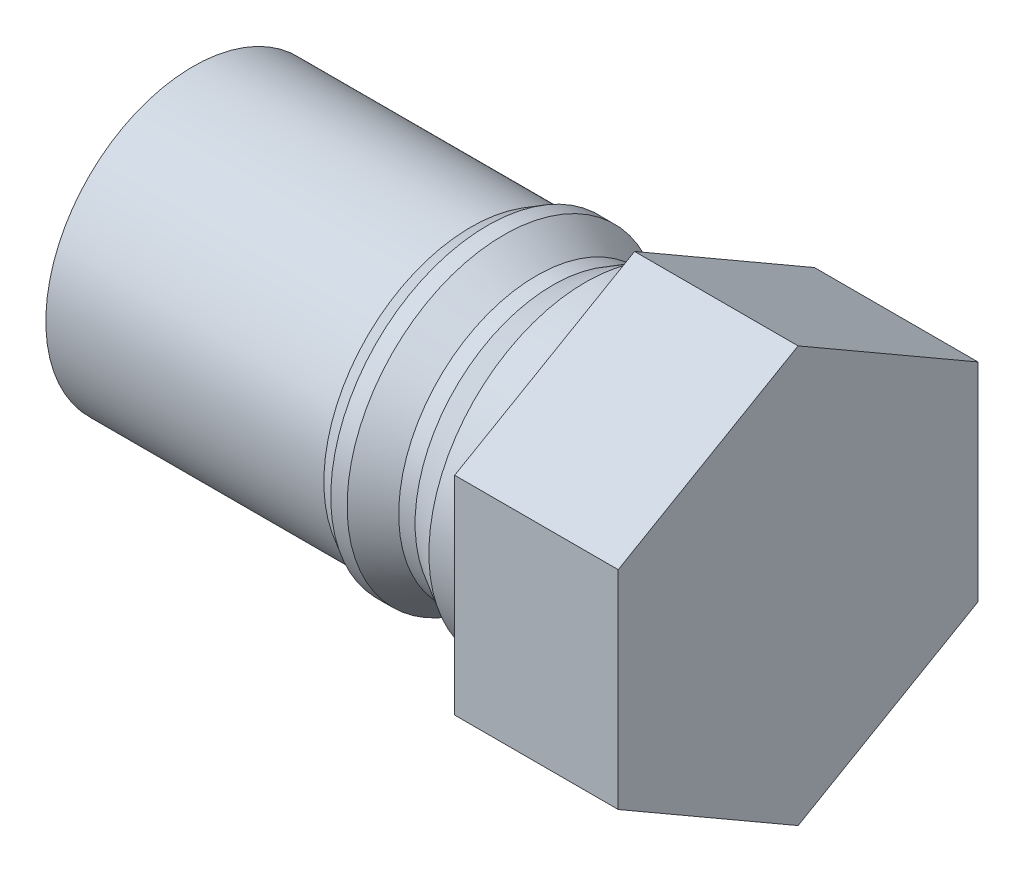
ISO-10303-21;
HEADER;
FILE_DESCRIPTION(('STEP AP214'),'2;1');
FILE_NAME('part.step','',(''),(''),'','','');
FILE_SCHEMA(('AUTOMOTIVE_DESIGN { 1 0 10303 214 1 1 1 1 }'));
ENDSEC;
DATA;
#1=APPLICATION_CONTEXT('core data for automotive mechanical design processes');
#2=APPLICATION_PROTOCOL_DEFINITION('international standard','automotive_design',2000,#1);
#3=PRODUCT_CONTEXT('',#1,'mechanical');
#4=PRODUCT('Part','Part','',(#3));
#5=PRODUCT_RELATED_PRODUCT_CATEGORY('part','',(#4));
#6=PRODUCT_DEFINITION_FORMATION('','',#4);
#7=PRODUCT_DEFINITION_CONTEXT('part definition',#1,'design');
#8=PRODUCT_DEFINITION('design','',#6,#7);
#9=PRODUCT_DEFINITION_SHAPE('','',#8);
#10=(LENGTH_UNIT() NAMED_UNIT(*) SI_UNIT(.MILLI.,.METRE.));
#11=(NAMED_UNIT(*) PLANE_ANGLE_UNIT() SI_UNIT($,.RADIAN.));
#12=(NAMED_UNIT(*) SI_UNIT($,.STERADIAN.) SOLID_ANGLE_UNIT());
#13=UNCERTAINTY_MEASURE_WITH_UNIT(LENGTH_MEASURE(1.E-05),#10,'distance_accuracy_value','');
#14=(GEOMETRIC_REPRESENTATION_CONTEXT(3) GLOBAL_UNCERTAINTY_ASSIGNED_CONTEXT((#13)) GLOBAL_UNIT_ASSIGNED_CONTEXT((#10,
#11,#12)) REPRESENTATION_CONTEXT('',''));
#15=CARTESIAN_POINT('',(0.,0.,0.));
#16=DIRECTION('',(0.,0.,1.));
#17=DIRECTION('',(1.,0.,0.));
#18=AXIS2_PLACEMENT_3D('',#15,#16,#17);
#19=CARTESIAN_POINT('',(0.,0.,0.));
#20=DIRECTION('',(-1.,0.,0.));
#21=DIRECTION('',(0.,0.,1.));
#22=AXIS2_PLACEMENT_3D('',#19,#20,#21);
#23=PLANE('',#22);
#24=CARTESIAN_POINT('',(0.,0.,0.));
#25=DIRECTION('',(1.,0.,0.));
#26=DIRECTION('',(0.,0.,-1.));
#27=AXIS2_PLACEMENT_3D('',#24,#25,#26);
#28=CIRCLE('',#27,9.);
#29=CARTESIAN_POINT('',(0.,0.,-9.));
#30=VERTEX_POINT('',#29);
#31=EDGE_CURVE('E11',#30,#30,#28,.T.);
#32=ORIENTED_EDGE('',*,*,#31,.F.);
#33=EDGE_LOOP('',(#32));
#34=FACE_BOUND('',#33,.T.);
#35=ADVANCED_FACE('F33',(#34),#23,.T.);
#36=CARTESIAN_POINT('',(27.,0.,0.));
#37=DIRECTION('',(1.,0.,0.));
#38=DIRECTION('',(0.,0.,-1.));
#39=AXIS2_PLACEMENT_3D('',#36,#37,#38);
#40=CYLINDRICAL_SURFACE('',#39,9.);
#41=ORIENTED_EDGE('',*,*,#31,.T.);
#42=EDGE_LOOP('',(#41));
#43=FACE_BOUND('',#42,.T.);
#44=CARTESIAN_POINT('',(17.,0.,0.));
#45=DIRECTION('',(1.,0.,0.));
#46=DIRECTION('',(0.,0.,-1.));
#47=AXIS2_PLACEMENT_3D('',#44,#45,#46);
#48=CIRCLE('',#47,9.);
#49=CARTESIAN_POINT('',(17.,0.,-9.));
#50=VERTEX_POINT('',#49);
#51=EDGE_CURVE('E41',#50,#50,#48,.T.);
#52=ORIENTED_EDGE('',*,*,#51,.F.);
#53=EDGE_LOOP('',(#52));
#54=FACE_BOUND('',#53,.T.);
#55=ADVANCED_FACE('F160',(#43,#54),#40,.T.);
#56=CARTESIAN_POINT('',(18.,0.,0.));
#57=DIRECTION('',(1.,0.,0.));
#58=DIRECTION('',(0.,0.,-1.));
#59=AXIS2_PLACEMENT_3D('',#56,#57,#58);
#60=CONICAL_SURFACE('',#59,9.57735026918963,0.5235987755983);
#61=ORIENTED_EDGE('',*,*,#51,.T.);
#62=EDGE_LOOP('',(#61));
#63=FACE_BOUND('',#62,.T.);
#64=CARTESIAN_POINT('',(18.,0.,0.));
#65=DIRECTION('',(1.,0.,0.));
#66=DIRECTION('',(0.,0.,-1.));
#67=AXIS2_PLACEMENT_3D('',#64,#65,#66);
#68=CIRCLE('',#67,9.57735026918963);
#69=CARTESIAN_POINT('',(18.,0.,-9.57735026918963));
#70=VERTEX_POINT('',#69);
#71=EDGE_CURVE('E152',#70,#70,#68,.T.);
#72=ORIENTED_EDGE('',*,*,#71,.F.);
#73=EDGE_LOOP('',(#72));
#74=FACE_BOUND('',#73,.T.);
#75=ADVANCED_FACE('F157',(#63,#74),#60,.T.);
#76=CARTESIAN_POINT('',(27.,0.,0.));
#77=DIRECTION('',(1.,0.,0.));
#78=DIRECTION('',(0.,0.,-1.));
#79=AXIS2_PLACEMENT_3D('',#76,#77,#78);
#80=CYLINDRICAL_SURFACE('',#79,9.57735026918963);
#81=ORIENTED_EDGE('',*,*,#71,.T.);
#82=EDGE_LOOP('',(#81));
#83=FACE_BOUND('',#82,.T.);
#84=CARTESIAN_POINT('',(19.,0.,0.));
#85=DIRECTION('',(1.,0.,0.));
#86=DIRECTION('',(0.,0.,-1.));
#87=AXIS2_PLACEMENT_3D('',#84,#85,#86);
#88=CIRCLE('',#87,9.57735026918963);
#89=CARTESIAN_POINT('',(19.,0.,-9.57735026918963));
#90=VERTEX_POINT('',#89);
#91=EDGE_CURVE('E149',#90,#90,#88,.T.);
#92=ORIENTED_EDGE('',*,*,#91,.F.);
#93=EDGE_LOOP('',(#92));
#94=FACE_BOUND('',#93,.T.);
#95=ADVANCED_FACE('F167',(#83,#94),#80,.T.);
#96=CARTESIAN_POINT('',(21.,0.,0.));
#97=DIRECTION('',(-1.,0.,0.));
#98=DIRECTION('',(0.,0.,1.));
#99=AXIS2_PLACEMENT_3D('',#96,#97,#98);
#100=CONICAL_SURFACE('',#99,8.42264973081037,0.5235987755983);
#101=ORIENTED_EDGE('',*,*,#91,.T.);
#102=EDGE_LOOP('',(#101));
#103=FACE_BOUND('',#102,.T.);
#104=CARTESIAN_POINT('',(21.,0.,0.));
#105=DIRECTION('',(1.,0.,0.));
#106=DIRECTION('',(0.,0.,-1.));
#107=AXIS2_PLACEMENT_3D('',#104,#105,#106);
#108=CIRCLE('',#107,8.42264973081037);
#109=CARTESIAN_POINT('',(21.,0.,-8.42264973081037));
#110=VERTEX_POINT('',#109);
#111=EDGE_CURVE('E146',#110,#110,#108,.T.);
#112=ORIENTED_EDGE('',*,*,#111,.F.);
#113=EDGE_LOOP('',(#112));
#114=FACE_BOUND('',#113,.T.);
#115=ADVANCED_FACE('F173',(#103,#114),#100,.T.);
#116=CARTESIAN_POINT('',(27.,0.,0.));
#117=DIRECTION('',(1.,0.,0.));
#118=DIRECTION('',(0.,0.,-1.));
#119=AXIS2_PLACEMENT_3D('',#116,#117,#118);
#120=CYLINDRICAL_SURFACE('',#119,8.42264973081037);
#121=ORIENTED_EDGE('',*,*,#111,.T.);
#122=EDGE_LOOP('',(#121));
#123=FACE_BOUND('',#122,.T.);
#124=CARTESIAN_POINT('',(22.,0.,0.));
#125=DIRECTION('',(1.,0.,0.));
#126=DIRECTION('',(0.,0.,-1.));
#127=AXIS2_PLACEMENT_3D('',#124,#125,#126);
#128=CIRCLE('',#127,8.42264973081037);
#129=CARTESIAN_POINT('',(22.,0.,-8.42264973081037));
#130=VERTEX_POINT('',#129);
#131=EDGE_CURVE('E143',#130,#130,#128,.T.);
#132=ORIENTED_EDGE('',*,*,#131,.F.);
#133=EDGE_LOOP('',(#132));
#134=FACE_BOUND('',#133,.T.);
#135=ADVANCED_FACE('F177',(#123,#134),#120,.T.);
#136=CARTESIAN_POINT('',(24.,0.,0.));
#137=DIRECTION('',(1.,0.,0.));
#138=DIRECTION('',(0.,0.,-1.));
#139=AXIS2_PLACEMENT_3D('',#136,#137,#138);
#140=CONICAL_SURFACE('',#139,9.57735026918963,0.523598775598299);
#141=ORIENTED_EDGE('',*,*,#131,.T.);
#142=EDGE_LOOP('',(#141));
#143=FACE_BOUND('',#142,.T.);
#144=CARTESIAN_POINT('',(24.,0.,0.));
#145=DIRECTION('',(1.,0.,0.));
#146=DIRECTION('',(0.,0.,-1.));
#147=AXIS2_PLACEMENT_3D('',#144,#145,#146);
#148=CIRCLE('',#147,9.57735026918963);
#149=CARTESIAN_POINT('',(24.,0.,-9.57735026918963));
#150=VERTEX_POINT('',#149);
#151=EDGE_CURVE('E140',#150,#150,#148,.T.);
#152=ORIENTED_EDGE('',*,*,#151,.F.);
#153=EDGE_LOOP('',(#152));
#154=FACE_BOUND('',#153,.T.);
#155=ADVANCED_FACE('F181',(#143,#154),#140,.T.);
#156=CARTESIAN_POINT('',(27.,0.,0.));
#157=DIRECTION('',(1.,0.,0.));
#158=DIRECTION('',(0.,0.,-1.));
#159=AXIS2_PLACEMENT_3D('',#156,#157,#158);
#160=CYLINDRICAL_SURFACE('',#159,9.57735026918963);
#161=ORIENTED_EDGE('',*,*,#151,.T.);
#162=EDGE_LOOP('',(#161));
#163=FACE_BOUND('',#162,.T.);
#164=CARTESIAN_POINT('',(27.,0.,0.));
#165=DIRECTION('',(1.,0.,0.));
#166=DIRECTION('',(0.,0.,-1.));
#167=AXIS2_PLACEMENT_3D('',#164,#165,#166);
#168=CIRCLE('',#167,9.57735026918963);
#169=CARTESIAN_POINT('',(27.,0.,-9.57735026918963));
#170=VERTEX_POINT('',#169);
#171=EDGE_CURVE('E137',#170,#170,#168,.T.);
#172=ORIENTED_EDGE('',*,*,#171,.F.);
#173=EDGE_LOOP('',(#172));
#174=FACE_BOUND('',#173,.T.);
#175=ADVANCED_FACE('F185',(#163,#174),#160,.T.);
#176=CARTESIAN_POINT('',(37.,6.35085296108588,-11.));
#177=DIRECTION('',(0.,-0.866025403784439,0.5));
#178=DIRECTION('',(0.,-0.5,-0.866025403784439));
#179=AXIS2_PLACEMENT_3D('',#176,#177,#178);
#180=PLANE('',#179);
#181=DIRECTION('',(0.,0.5,0.866025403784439));
#182=VECTOR('',#181,1.);
#183=CARTESIAN_POINT('',(27.,6.35085296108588,-11.));
#184=LINE('',#183,#182);
#185=CARTESIAN_POINT('',(27.,6.35085296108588,-11.));
#186=VERTEX_POINT('',#185);
#187=CARTESIAN_POINT('',(27.,12.7017059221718,0.));
#188=VERTEX_POINT('',#187);
#189=EDGE_CURVE('E118',#186,#188,#184,.T.);
#190=ORIENTED_EDGE('',*,*,#189,.T.);
#191=DIRECTION('',(-1.,0.,0.));
#192=VECTOR('',#191,1.);
#193=CARTESIAN_POINT('',(37.,12.7017059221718,0.));
#194=LINE('',#193,#192);
#195=CARTESIAN_POINT('',(37.,12.7017059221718,0.));
#196=VERTEX_POINT('',#195);
#197=EDGE_CURVE('E135',#196,#188,#194,.T.);
#198=ORIENTED_EDGE('',*,*,#197,.F.);
#199=DIRECTION('',(0.,0.5,0.866025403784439));
#200=VECTOR('',#199,1.);
#201=CARTESIAN_POINT('',(37.,6.35085296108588,-11.));
#202=LINE('',#201,#200);
#203=CARTESIAN_POINT('',(37.,6.35085296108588,-11.));
#204=VERTEX_POINT('',#203);
#205=EDGE_CURVE('E128',#204,#196,#202,.T.);
#206=ORIENTED_EDGE('',*,*,#205,.F.);
#207=DIRECTION('',(-1.,0.,0.));
#208=VECTOR('',#207,1.);
#209=CARTESIAN_POINT('',(37.,6.35085296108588,-11.));
#210=LINE('',#209,#208);
#211=EDGE_CURVE('E114',#204,#186,#210,.T.);
#212=ORIENTED_EDGE('',*,*,#211,.T.);
#213=EDGE_LOOP('',(#190,#198,#206,#212));
#214=FACE_BOUND('',#213,.T.);
#215=ADVANCED_FACE('F189',(#214),#180,.F.);
#216=CARTESIAN_POINT('',(37.,12.7017059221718,0.));
#217=DIRECTION('',(0.,-0.866025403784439,-0.5));
#218=DIRECTION('',(0.,0.5,-0.866025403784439));
#219=AXIS2_PLACEMENT_3D('',#216,#217,#218);
#220=PLANE('',#219);
#221=DIRECTION('',(0.,-0.5,0.866025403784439));
#222=VECTOR('',#221,1.);
#223=CARTESIAN_POINT('',(27.,12.7017059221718,0.));
#224=LINE('',#223,#222);
#225=CARTESIAN_POINT('',(27.,6.35085296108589,11.));
#226=VERTEX_POINT('',#225);
#227=EDGE_CURVE('E121',#188,#226,#224,.T.);
#228=ORIENTED_EDGE('',*,*,#227,.T.);
#229=DIRECTION('',(-1.,0.,0.));
#230=VECTOR('',#229,1.);
#231=CARTESIAN_POINT('',(37.,6.35085296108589,11.));
#232=LINE('',#231,#230);
#233=CARTESIAN_POINT('',(37.,6.35085296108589,11.));
#234=VERTEX_POINT('',#233);
#235=EDGE_CURVE('E132',#234,#226,#232,.T.);
#236=ORIENTED_EDGE('',*,*,#235,.F.);
#237=DIRECTION('',(0.,-0.5,0.866025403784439));
#238=VECTOR('',#237,1.);
#239=CARTESIAN_POINT('',(37.,12.7017059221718,0.));
#240=LINE('',#239,#238);
#241=EDGE_CURVE('E87',#196,#234,#240,.T.);
#242=ORIENTED_EDGE('',*,*,#241,.F.);
#243=ORIENTED_EDGE('',*,*,#197,.T.);
#244=EDGE_LOOP('',(#228,#236,#242,#243));
#245=FACE_BOUND('',#244,.T.);
#246=ADVANCED_FACE('F193',(#245),#220,.F.);
#247=CARTESIAN_POINT('',(37.,6.35085296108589,11.));
#248=DIRECTION('',(0.,0.,-1.));
#249=DIRECTION('',(-1.,0.,0.));
#250=AXIS2_PLACEMENT_3D('',#247,#248,#249);
#251=PLANE('',#250);
#252=DIRECTION('',(0.,-1.,0.));
#253=VECTOR('',#252,1.);
#254=CARTESIAN_POINT('',(27.,6.35085296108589,11.));
#255=LINE('',#254,#253);
#256=CARTESIAN_POINT('',(27.,-6.35085296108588,11.));
#257=VERTEX_POINT('',#256);
#258=EDGE_CURVE('E123',#226,#257,#255,.T.);
#259=ORIENTED_EDGE('',*,*,#258,.T.);
#260=DIRECTION('',(-1.,0.,0.));
#261=VECTOR('',#260,1.);
#262=CARTESIAN_POINT('',(37.,-6.35085296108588,11.));
#263=LINE('',#262,#261);
#264=CARTESIAN_POINT('',(37.,-6.35085296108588,11.));
#265=VERTEX_POINT('',#264);
#266=EDGE_CURVE('E109',#265,#257,#263,.T.);
#267=ORIENTED_EDGE('',*,*,#266,.F.);
#268=DIRECTION('',(0.,-1.,0.));
#269=VECTOR('',#268,1.);
#270=CARTESIAN_POINT('',(37.,6.35085296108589,11.));
#271=LINE('',#270,#269);
#272=EDGE_CURVE('E100',#234,#265,#271,.T.);
#273=ORIENTED_EDGE('',*,*,#272,.F.);
#274=ORIENTED_EDGE('',*,*,#235,.T.);
#275=EDGE_LOOP('',(#259,#267,#273,#274));
#276=FACE_BOUND('',#275,.T.);
#277=ADVANCED_FACE('F197',(#276),#251,.F.);
#278=CARTESIAN_POINT('',(37.,-6.35085296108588,11.));
#279=DIRECTION('',(0.,0.866025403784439,-0.5));
#280=DIRECTION('',(0.,0.5,0.866025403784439));
#281=AXIS2_PLACEMENT_3D('',#278,#279,#280);
#282=PLANE('',#281);
#283=DIRECTION('',(0.,-0.5,-0.866025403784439));
#284=VECTOR('',#283,1.);
#285=CARTESIAN_POINT('',(27.,-6.35085296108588,11.));
#286=LINE('',#285,#284);
#287=CARTESIAN_POINT('',(27.,-12.7017059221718,0.));
#288=VERTEX_POINT('',#287);
#289=EDGE_CURVE('E108',#257,#288,#286,.T.);
#290=ORIENTED_EDGE('',*,*,#289,.T.);
#291=DIRECTION('',(-1.,0.,0.));
#292=VECTOR('',#291,1.);
#293=CARTESIAN_POINT('',(37.,-12.7017059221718,0.));
#294=LINE('',#293,#292);
#295=CARTESIAN_POINT('',(37.,-12.7017059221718,0.));
#296=VERTEX_POINT('',#295);
#297=EDGE_CURVE('E105',#296,#288,#294,.T.);
#298=ORIENTED_EDGE('',*,*,#297,.F.);
#299=DIRECTION('',(0.,-0.5,-0.866025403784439));
#300=VECTOR('',#299,1.);
#301=CARTESIAN_POINT('',(37.,-6.35085296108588,11.));
#302=LINE('',#301,#300);
#303=EDGE_CURVE('E94',#265,#296,#302,.T.);
#304=ORIENTED_EDGE('',*,*,#303,.F.);
#305=ORIENTED_EDGE('',*,*,#266,.T.);
#306=EDGE_LOOP('',(#290,#298,#304,#305));
#307=FACE_BOUND('',#306,.T.);
#308=ADVANCED_FACE('F106',(#307),#282,.F.);
#309=CARTESIAN_POINT('',(37.,-12.7017059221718,0.));
#310=DIRECTION('',(0.,0.866025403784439,0.5));
#311=DIRECTION('',(0.,-0.5,0.866025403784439));
#312=AXIS2_PLACEMENT_3D('',#309,#310,#311);
#313=PLANE('',#312);
#314=DIRECTION('',(0.,0.5,-0.866025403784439));
#315=VECTOR('',#314,1.);
#316=CARTESIAN_POINT('',(27.,-12.7017059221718,0.));
#317=LINE('',#316,#315);
#318=CARTESIAN_POINT('',(27.,-6.35085296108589,-11.));
#319=VERTEX_POINT('',#318);
#320=EDGE_CURVE('E72',#288,#319,#317,.T.);
#321=ORIENTED_EDGE('',*,*,#320,.T.);
#322=DIRECTION('',(-1.,0.,0.));
#323=VECTOR('',#322,1.);
#324=CARTESIAN_POINT('',(37.,-6.35085296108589,-11.));
#325=LINE('',#324,#323);
#326=CARTESIAN_POINT('',(37.,-6.35085296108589,-11.));
#327=VERTEX_POINT('',#326);
#328=EDGE_CURVE('E110',#327,#319,#325,.T.);
#329=ORIENTED_EDGE('',*,*,#328,.F.);
#330=DIRECTION('',(0.,0.5,-0.866025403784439));
#331=VECTOR('',#330,1.);
#332=CARTESIAN_POINT('',(37.,-12.7017059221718,0.));
#333=LINE('',#332,#331);
#334=EDGE_CURVE('E98',#296,#327,#333,.T.);
#335=ORIENTED_EDGE('',*,*,#334,.F.);
#336=ORIENTED_EDGE('',*,*,#297,.T.);
#337=EDGE_LOOP('',(#321,#329,#335,#336));
#338=FACE_BOUND('',#337,.T.);
#339=ADVANCED_FACE('F112',(#338),#313,.F.);
#340=CARTESIAN_POINT('',(37.,-6.35085296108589,-11.));
#341=DIRECTION('',(0.,0.,1.));
#342=DIRECTION('',(1.,0.,0.));
#343=AXIS2_PLACEMENT_3D('',#340,#341,#342);
#344=PLANE('',#343);
#345=DIRECTION('',(0.,1.,0.));
#346=VECTOR('',#345,1.);
#347=CARTESIAN_POINT('',(27.,-6.35085296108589,-11.));
#348=LINE('',#347,#346);
#349=EDGE_CURVE('E78',#319,#186,#348,.T.);
#350=ORIENTED_EDGE('',*,*,#349,.T.);
#351=ORIENTED_EDGE('',*,*,#211,.F.);
#352=DIRECTION('',(0.,1.,0.));
#353=VECTOR('',#352,1.);
#354=CARTESIAN_POINT('',(37.,-6.35085296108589,-11.));
#355=LINE('',#354,#353);
#356=EDGE_CURVE('E49',#327,#204,#355,.T.);
#357=ORIENTED_EDGE('',*,*,#356,.F.);
#358=ORIENTED_EDGE('',*,*,#328,.T.);
#359=EDGE_LOOP('',(#350,#351,#357,#358));
#360=FACE_BOUND('',#359,.T.);
#361=ADVANCED_FACE('F205',(#360),#344,.F.);
#362=CARTESIAN_POINT('',(37.,0.,0.));
#363=DIRECTION('',(1.,0.,0.));
#364=DIRECTION('',(0.,0.,-1.));
#365=AXIS2_PLACEMENT_3D('',#362,#363,#364);
#366=PLANE('',#365);
#367=ORIENTED_EDGE('',*,*,#205,.T.);
#368=ORIENTED_EDGE('',*,*,#241,.T.);
#369=ORIENTED_EDGE('',*,*,#272,.T.);
#370=ORIENTED_EDGE('',*,*,#303,.T.);
#371=ORIENTED_EDGE('',*,*,#334,.T.);
#372=ORIENTED_EDGE('',*,*,#356,.T.);
#373=EDGE_LOOP('',(#367,#368,#369,#370,#371,#372));
#374=FACE_BOUND('',#373,.T.);
#375=ADVANCED_FACE('F96',(#374),#366,.T.);
#376=CARTESIAN_POINT('',(27.,0.,0.));
#377=DIRECTION('',(1.,0.,0.));
#378=DIRECTION('',(0.,0.,-1.));
#379=AXIS2_PLACEMENT_3D('',#376,#377,#378);
#380=PLANE('',#379);
#381=ORIENTED_EDGE('',*,*,#171,.T.);
#382=EDGE_LOOP('',(#381));
#383=FACE_BOUND('',#382,.T.);
#384=ORIENTED_EDGE('',*,*,#189,.F.);
#385=ORIENTED_EDGE('',*,*,#349,.F.);
#386=ORIENTED_EDGE('',*,*,#320,.F.);
#387=ORIENTED_EDGE('',*,*,#289,.F.);
#388=ORIENTED_EDGE('',*,*,#258,.F.);
#389=ORIENTED_EDGE('',*,*,#227,.F.);
#390=EDGE_LOOP('',(#384,#385,#386,#387,#388,#389));
#391=FACE_BOUND('',#390,.T.);
#392=ADVANCED_FACE('F208',(#383,#391),#380,.F.);
#393=CLOSED_SHELL('',(#35,#55,#75,#95,#115,#135,#155,#175,#215,#246,#277,#308,#339,#361,#375,#392));
#394=MANIFOLD_SOLID_BREP('B2',#393);
#395=ADVANCED_BREP_SHAPE_REPRESENTATION('',(#18,#394),#14);
#396=SHAPE_DEFINITION_REPRESENTATION(#9,#395);
ENDSEC;
END-ISO-10303-21;
